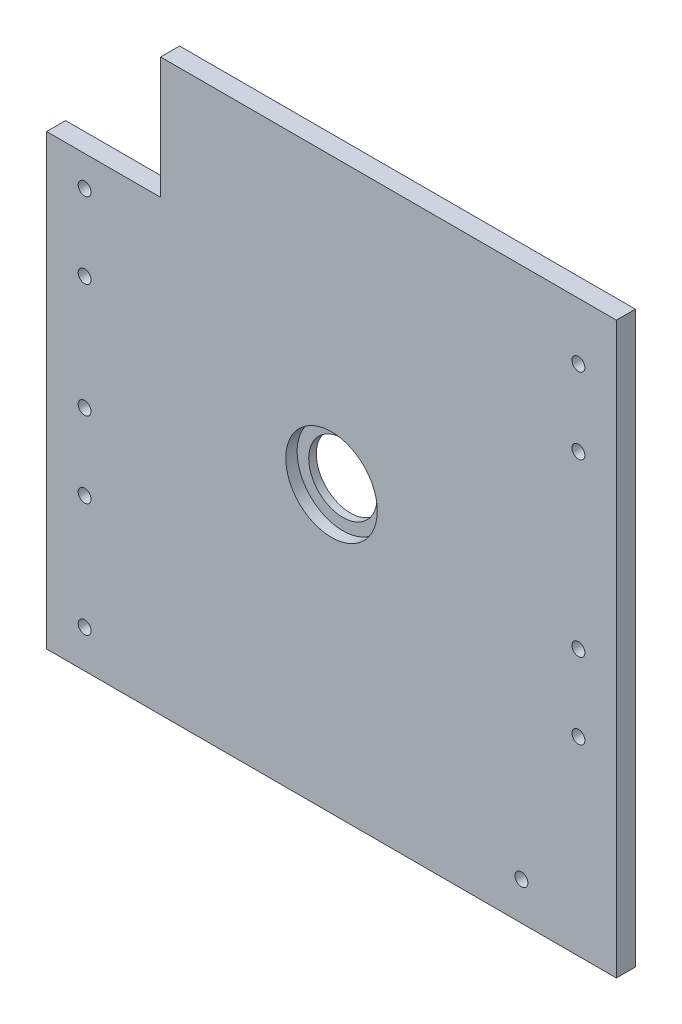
ISO-10303-21;
HEADER;
FILE_DESCRIPTION(('STEP AP214'),'2;1');
FILE_NAME('part.step','',(''),(''),'','','');
FILE_SCHEMA(('AUTOMOTIVE_DESIGN { 1 0 10303 214 1 1 1 1 }'));
ENDSEC;
DATA;
#1=APPLICATION_CONTEXT('core data for automotive mechanical design processes');
#2=APPLICATION_PROTOCOL_DEFINITION('international standard','automotive_design',2000,#1);
#3=PRODUCT_CONTEXT('',#1,'mechanical');
#4=PRODUCT('Part','Part','',(#3));
#5=PRODUCT_RELATED_PRODUCT_CATEGORY('part','',(#4));
#6=PRODUCT_DEFINITION_FORMATION('','',#4);
#7=PRODUCT_DEFINITION_CONTEXT('part definition',#1,'design');
#8=PRODUCT_DEFINITION('design','',#6,#7);
#9=PRODUCT_DEFINITION_SHAPE('','',#8);
#10=(LENGTH_UNIT() NAMED_UNIT(*) SI_UNIT(.MILLI.,.METRE.));
#11=(NAMED_UNIT(*) PLANE_ANGLE_UNIT() SI_UNIT($,.RADIAN.));
#12=(NAMED_UNIT(*) SI_UNIT($,.STERADIAN.) SOLID_ANGLE_UNIT());
#13=UNCERTAINTY_MEASURE_WITH_UNIT(LENGTH_MEASURE(1.E-05),#10,'distance_accuracy_value','');
#14=(GEOMETRIC_REPRESENTATION_CONTEXT(3) GLOBAL_UNCERTAINTY_ASSIGNED_CONTEXT((#13)) GLOBAL_UNIT_ASSIGNED_CONTEXT((#10,
#11,#12)) REPRESENTATION_CONTEXT('',''));
#15=CARTESIAN_POINT('',(0.,0.,0.));
#16=DIRECTION('',(0.,0.,1.));
#17=DIRECTION('',(1.,0.,0.));
#18=AXIS2_PLACEMENT_3D('',#15,#16,#17);
#19=CARTESIAN_POINT('',(0.,0.,5.));
#20=DIRECTION('',(0.,0.,-1.));
#21=DIRECTION('',(-1.,0.,0.));
#22=AXIS2_PLACEMENT_3D('',#19,#20,#21);
#23=CYLINDRICAL_SURFACE('',#22,9.);
#24=CARTESIAN_POINT('',(0.,0.,0.));
#25=DIRECTION('',(0.,0.,-1.));
#26=DIRECTION('',(-1.,0.,0.));
#27=AXIS2_PLACEMENT_3D('',#24,#25,#26);
#28=CIRCLE('',#27,9.);
#29=CARTESIAN_POINT('',(-9.,0.,0.));
#30=VERTEX_POINT('',#29);
#31=EDGE_CURVE('E132',#30,#30,#28,.T.);
#32=ORIENTED_EDGE('',*,*,#31,.T.);
#33=EDGE_LOOP('',(#32));
#34=FACE_BOUND('',#33,.T.);
#35=CARTESIAN_POINT('',(0.,0.,2.));
#36=DIRECTION('',(0.,0.,1.));
#37=DIRECTION('',(1.,0.,0.));
#38=AXIS2_PLACEMENT_3D('',#35,#36,#37);
#39=CIRCLE('',#38,9.);
#40=CARTESIAN_POINT('',(9.,0.,2.));
#41=VERTEX_POINT('',#40);
#42=EDGE_CURVE('E43',#41,#41,#39,.F.);
#43=ORIENTED_EDGE('',*,*,#42,.F.);
#44=EDGE_LOOP('',(#43));
#45=FACE_BOUND('',#44,.T.);
#46=ADVANCED_FACE('F39',(#34,#45),#23,.F.);
#47=CARTESIAN_POINT('',(75.,75.,5.));
#48=DIRECTION('',(-1.,0.,0.));
#49=DIRECTION('',(0.,0.,1.));
#50=AXIS2_PLACEMENT_3D('',#47,#48,#49);
#51=PLANE('',#50);
#52=DIRECTION('',(0.,1.,0.));
#53=VECTOR('',#52,1.);
#54=CARTESIAN_POINT('',(75.,75.,0.));
#55=LINE('',#54,#53);
#56=CARTESIAN_POINT('',(75.,-75.,0.));
#57=VERTEX_POINT('',#56);
#58=CARTESIAN_POINT('',(75.,75.,0.));
#59=VERTEX_POINT('',#58);
#60=EDGE_CURVE('E212',#57,#59,#55,.T.);
#61=ORIENTED_EDGE('',*,*,#60,.T.);
#62=DIRECTION('',(0.,0.,-1.));
#63=VECTOR('',#62,1.);
#64=CARTESIAN_POINT('',(75.,75.,5.));
#65=LINE('',#64,#63);
#66=CARTESIAN_POINT('',(75.,75.,5.));
#67=VERTEX_POINT('',#66);
#68=EDGE_CURVE('E11',#67,#59,#65,.T.);
#69=ORIENTED_EDGE('',*,*,#68,.F.);
#70=DIRECTION('',(0.,1.,0.));
#71=VECTOR('',#70,1.);
#72=CARTESIAN_POINT('',(75.,75.,5.));
#73=LINE('',#72,#71);
#74=CARTESIAN_POINT('',(75.,-75.,5.));
#75=VERTEX_POINT('',#74);
#76=EDGE_CURVE('E205',#75,#67,#73,.T.);
#77=ORIENTED_EDGE('',*,*,#76,.F.);
#78=DIRECTION('',(0.,0.,-1.));
#79=VECTOR('',#78,1.);
#80=CARTESIAN_POINT('',(75.,-75.,5.));
#81=LINE('',#80,#79);
#82=EDGE_CURVE('E211',#75,#57,#81,.T.);
#83=ORIENTED_EDGE('',*,*,#82,.T.);
#84=EDGE_LOOP('',(#61,#69,#77,#83));
#85=FACE_BOUND('',#84,.T.);
#86=ADVANCED_FACE('F41',(#85),#51,.F.);
#87=CARTESIAN_POINT('',(-75.,75.,5.));
#88=DIRECTION('',(0.,-1.,0.));
#89=DIRECTION('',(0.,0.,-1.));
#90=AXIS2_PLACEMENT_3D('',#87,#88,#89);
#91=PLANE('',#90);
#92=DIRECTION('',(-1.,0.,0.));
#93=VECTOR('',#92,1.);
#94=CARTESIAN_POINT('',(-75.,75.,0.));
#95=LINE('',#94,#93);
#96=CARTESIAN_POINT('',(-45.,75.,0.));
#97=VERTEX_POINT('',#96);
#98=EDGE_CURVE('E215',#59,#97,#95,.T.);
#99=ORIENTED_EDGE('',*,*,#98,.T.);
#100=DIRECTION('',(0.,0.,-1.));
#101=VECTOR('',#100,1.);
#102=CARTESIAN_POINT('',(-45.,75.,5.));
#103=LINE('',#102,#101);
#104=CARTESIAN_POINT('',(-45.,75.,5.));
#105=VERTEX_POINT('',#104);
#106=EDGE_CURVE('E123',#105,#97,#103,.T.);
#107=ORIENTED_EDGE('',*,*,#106,.F.);
#108=DIRECTION('',(-1.,0.,0.));
#109=VECTOR('',#108,1.);
#110=CARTESIAN_POINT('',(-75.,75.,5.));
#111=LINE('',#110,#109);
#112=EDGE_CURVE('E88',#67,#105,#111,.T.);
#113=ORIENTED_EDGE('',*,*,#112,.F.);
#114=ORIENTED_EDGE('',*,*,#68,.T.);
#115=EDGE_LOOP('',(#99,#107,#113,#114));
#116=FACE_BOUND('',#115,.T.);
#117=ADVANCED_FACE('F294',(#116),#91,.F.);
#118=CARTESIAN_POINT('',(-75.,75.,5.));
#119=DIRECTION('',(1.,0.,0.));
#120=DIRECTION('',(0.,1.,0.));
#121=AXIS2_PLACEMENT_3D('',#118,#119,#120);
#122=PLANE('',#121);
#123=DIRECTION('',(0.,-1.,0.));
#124=VECTOR('',#123,1.);
#125=CARTESIAN_POINT('',(-75.,75.,5.));
#126=LINE('',#125,#124);
#127=CARTESIAN_POINT('',(-75.,43.,5.));
#128=VERTEX_POINT('',#127);
#129=CARTESIAN_POINT('',(-75.,-75.,5.));
#130=VERTEX_POINT('',#129);
#131=EDGE_CURVE('E208',#128,#130,#126,.T.);
#132=ORIENTED_EDGE('',*,*,#131,.F.);
#133=DIRECTION('',(0.,0.,-1.));
#134=VECTOR('',#133,1.);
#135=CARTESIAN_POINT('',(-75.,43.,5.));
#136=LINE('',#135,#134);
#137=CARTESIAN_POINT('',(-75.,43.,0.));
#138=VERTEX_POINT('',#137);
#139=EDGE_CURVE('E108',#128,#138,#136,.T.);
#140=ORIENTED_EDGE('',*,*,#139,.T.);
#141=DIRECTION('',(0.,-1.,0.));
#142=VECTOR('',#141,1.);
#143=CARTESIAN_POINT('',(-75.,75.,0.));
#144=LINE('',#143,#142);
#145=CARTESIAN_POINT('',(-75.,-75.,0.));
#146=VERTEX_POINT('',#145);
#147=EDGE_CURVE('E218',#138,#146,#144,.T.);
#148=ORIENTED_EDGE('',*,*,#147,.T.);
#149=DIRECTION('',(0.,0.,-1.));
#150=VECTOR('',#149,1.);
#151=CARTESIAN_POINT('',(-75.,-75.,5.));
#152=LINE('',#151,#150);
#153=EDGE_CURVE('E48',#130,#146,#152,.T.);
#154=ORIENTED_EDGE('',*,*,#153,.F.);
#155=EDGE_LOOP('',(#132,#140,#148,#154));
#156=FACE_BOUND('',#155,.T.);
#157=ADVANCED_FACE('F288',(#156),#122,.F.);
#158=CARTESIAN_POINT('',(-75.,-75.,5.));
#159=DIRECTION('',(0.,1.,0.));
#160=DIRECTION('',(0.,0.,1.));
#161=AXIS2_PLACEMENT_3D('',#158,#159,#160);
#162=PLANE('',#161);
#163=DIRECTION('',(1.,0.,0.));
#164=VECTOR('',#163,1.);
#165=CARTESIAN_POINT('',(-75.,-75.,0.));
#166=LINE('',#165,#164);
#167=EDGE_CURVE('E82',#146,#57,#166,.T.);
#168=ORIENTED_EDGE('',*,*,#167,.T.);
#169=ORIENTED_EDGE('',*,*,#82,.F.);
#170=DIRECTION('',(1.,0.,0.));
#171=VECTOR('',#170,1.);
#172=CARTESIAN_POINT('',(-75.,-75.,5.));
#173=LINE('',#172,#171);
#174=EDGE_CURVE('E65',#130,#75,#173,.T.);
#175=ORIENTED_EDGE('',*,*,#174,.F.);
#176=ORIENTED_EDGE('',*,*,#153,.T.);
#177=EDGE_LOOP('',(#168,#169,#175,#176));
#178=FACE_BOUND('',#177,.T.);
#179=ADVANCED_FACE('F249',(#178),#162,.F.);
#180=CARTESIAN_POINT('',(0.,0.,5.));
#181=DIRECTION('',(0.,0.,1.));
#182=DIRECTION('',(1.,0.,0.));
#183=AXIS2_PLACEMENT_3D('',#180,#181,#182);
#184=PLANE('',#183);
#185=DIRECTION('',(0.,-1.,0.));
#186=VECTOR('',#185,1.);
#187=CARTESIAN_POINT('',(-45.,75.,5.));
#188=LINE('',#187,#186);
#189=CARTESIAN_POINT('',(-45.,43.,5.));
#190=VERTEX_POINT('',#189);
#191=EDGE_CURVE('E105',#105,#190,#188,.T.);
#192=ORIENTED_EDGE('',*,*,#191,.T.);
#193=DIRECTION('',(-1.,0.,0.));
#194=VECTOR('',#193,1.);
#195=CARTESIAN_POINT('',(-45.,43.,5.));
#196=LINE('',#195,#194);
#197=EDGE_CURVE('E109',#190,#128,#196,.T.);
#198=ORIENTED_EDGE('',*,*,#197,.T.);
#199=ORIENTED_EDGE('',*,*,#131,.T.);
#200=ORIENTED_EDGE('',*,*,#174,.T.);
#201=ORIENTED_EDGE('',*,*,#76,.T.);
#202=ORIENTED_EDGE('',*,*,#112,.T.);
#203=EDGE_LOOP('',(#192,#198,#199,#200,#201,#202));
#204=FACE_BOUND('',#203,.T.);
#205=CARTESIAN_POINT('',(0.,0.,5.));
#206=DIRECTION('',(0.,0.,1.));
#207=DIRECTION('',(1.,0.,0.));
#208=AXIS2_PLACEMENT_3D('',#205,#206,#207);
#209=CIRCLE('',#208,12.05);
#210=CARTESIAN_POINT('',(12.05,0.,5.));
#211=VERTEX_POINT('',#210);
#212=EDGE_CURVE('E125',#211,#211,#209,.T.);
#213=ORIENTED_EDGE('',*,*,#212,.F.);
#214=EDGE_LOOP('',(#213));
#215=FACE_BOUND('',#214,.T.);
#216=CARTESIAN_POINT('',(-65.,35.,5.));
#217=DIRECTION('',(0.,0.,1.));
#218=DIRECTION('',(1.,0.,0.));
#219=AXIS2_PLACEMENT_3D('',#216,#217,#218);
#220=CIRCLE('',#219,1.69999999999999);
#221=CARTESIAN_POINT('',(-63.3,35.,5.));
#222=VERTEX_POINT('',#221);
#223=EDGE_CURVE('E141',#222,#222,#220,.T.);
#224=ORIENTED_EDGE('',*,*,#223,.F.);
#225=EDGE_LOOP('',(#224));
#226=FACE_BOUND('',#225,.T.);
#227=CARTESIAN_POINT('',(-65.,15.,5.));
#228=DIRECTION('',(0.,0.,1.));
#229=DIRECTION('',(1.,0.,0.));
#230=AXIS2_PLACEMENT_3D('',#227,#228,#229);
#231=CIRCLE('',#230,1.69999999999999);
#232=CARTESIAN_POINT('',(-63.3,15.,5.));
#233=VERTEX_POINT('',#232);
#234=EDGE_CURVE('E148',#233,#233,#231,.T.);
#235=ORIENTED_EDGE('',*,*,#234,.F.);
#236=EDGE_LOOP('',(#235));
#237=FACE_BOUND('',#236,.T.);
#238=CARTESIAN_POINT('',(-65.,-15.,5.));
#239=DIRECTION('',(0.,0.,1.));
#240=DIRECTION('',(1.,0.,0.));
#241=AXIS2_PLACEMENT_3D('',#238,#239,#240);
#242=CIRCLE('',#241,1.69999999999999);
#243=CARTESIAN_POINT('',(-63.3,-15.,5.));
#244=VERTEX_POINT('',#243);
#245=EDGE_CURVE('E155',#244,#244,#242,.T.);
#246=ORIENTED_EDGE('',*,*,#245,.F.);
#247=EDGE_LOOP('',(#246));
#248=FACE_BOUND('',#247,.T.);
#249=CARTESIAN_POINT('',(-65.,-35.,5.));
#250=DIRECTION('',(0.,0.,1.));
#251=DIRECTION('',(1.,0.,0.));
#252=AXIS2_PLACEMENT_3D('',#249,#250,#251);
#253=CIRCLE('',#252,1.69999999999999);
#254=CARTESIAN_POINT('',(-63.3,-35.,5.));
#255=VERTEX_POINT('',#254);
#256=EDGE_CURVE('E162',#255,#255,#253,.T.);
#257=ORIENTED_EDGE('',*,*,#256,.F.);
#258=EDGE_LOOP('',(#257));
#259=FACE_BOUND('',#258,.T.);
#260=CARTESIAN_POINT('',(-65.,-65.,5.));
#261=DIRECTION('',(0.,0.,1.));
#262=DIRECTION('',(1.,0.,0.));
#263=AXIS2_PLACEMENT_3D('',#260,#261,#262);
#264=CIRCLE('',#263,1.69999999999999);
#265=CARTESIAN_POINT('',(-63.3,-65.,5.));
#266=VERTEX_POINT('',#265);
#267=EDGE_CURVE('E169',#266,#266,#264,.T.);
#268=ORIENTED_EDGE('',*,*,#267,.F.);
#269=EDGE_LOOP('',(#268));
#270=FACE_BOUND('',#269,.T.);
#271=CARTESIAN_POINT('',(65.,60.,5.));
#272=DIRECTION('',(0.,0.,1.));
#273=DIRECTION('',(1.,0.,0.));
#274=AXIS2_PLACEMENT_3D('',#271,#272,#273);
#275=CIRCLE('',#274,1.69999999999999);
#276=CARTESIAN_POINT('',(66.7,60.,5.));
#277=VERTEX_POINT('',#276);
#278=EDGE_CURVE('E176',#277,#277,#275,.T.);
#279=ORIENTED_EDGE('',*,*,#278,.F.);
#280=EDGE_LOOP('',(#279));
#281=FACE_BOUND('',#280,.T.);
#282=CARTESIAN_POINT('',(65.,40.,5.));
#283=DIRECTION('',(0.,0.,1.));
#284=DIRECTION('',(1.,0.,0.));
#285=AXIS2_PLACEMENT_3D('',#282,#283,#284);
#286=CIRCLE('',#285,1.69999999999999);
#287=CARTESIAN_POINT('',(66.7,40.,5.));
#288=VERTEX_POINT('',#287);
#289=EDGE_CURVE('E183',#288,#288,#286,.T.);
#290=ORIENTED_EDGE('',*,*,#289,.F.);
#291=EDGE_LOOP('',(#290));
#292=FACE_BOUND('',#291,.T.);
#293=CARTESIAN_POINT('',(65.,-4.99999999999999,5.));
#294=DIRECTION('',(0.,0.,1.));
#295=DIRECTION('',(1.,0.,0.));
#296=AXIS2_PLACEMENT_3D('',#293,#294,#295);
#297=CIRCLE('',#296,1.69999999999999);
#298=CARTESIAN_POINT('',(66.7,-4.99999999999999,5.));
#299=VERTEX_POINT('',#298);
#300=EDGE_CURVE('E190',#299,#299,#297,.T.);
#301=ORIENTED_EDGE('',*,*,#300,.F.);
#302=EDGE_LOOP('',(#301));
#303=FACE_BOUND('',#302,.T.);
#304=CARTESIAN_POINT('',(65.,-25.,5.));
#305=DIRECTION('',(0.,0.,1.));
#306=DIRECTION('',(1.,0.,0.));
#307=AXIS2_PLACEMENT_3D('',#304,#305,#306);
#308=CIRCLE('',#307,1.69999999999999);
#309=CARTESIAN_POINT('',(66.7,-25.,5.));
#310=VERTEX_POINT('',#309);
#311=EDGE_CURVE('E197',#310,#310,#308,.T.);
#312=ORIENTED_EDGE('',*,*,#311,.F.);
#313=EDGE_LOOP('',(#312));
#314=FACE_BOUND('',#313,.T.);
#315=CARTESIAN_POINT('',(50.,-65.,5.));
#316=DIRECTION('',(0.,0.,1.));
#317=DIRECTION('',(1.,0.,0.));
#318=AXIS2_PLACEMENT_3D('',#315,#316,#317);
#319=CIRCLE('',#318,1.69999999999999);
#320=CARTESIAN_POINT('',(51.7,-65.,5.));
#321=VERTEX_POINT('',#320);
#322=EDGE_CURVE('E204',#321,#321,#319,.T.);
#323=ORIENTED_EDGE('',*,*,#322,.F.);
#324=EDGE_LOOP('',(#323));
#325=FACE_BOUND('',#324,.T.);
#326=ADVANCED_FACE('F116',(#204,#215,#226,#237,#248,#259,#270,#281,#292,#303,#314,#325),#184,.T.);
#327=CARTESIAN_POINT('',(0.,0.,0.));
#328=DIRECTION('',(0.,0.,1.));
#329=DIRECTION('',(1.,0.,0.));
#330=AXIS2_PLACEMENT_3D('',#327,#328,#329);
#331=PLANE('',#330);
#332=ORIENTED_EDGE('',*,*,#31,.F.);
#333=EDGE_LOOP('',(#332));
#334=FACE_BOUND('',#333,.T.);
#335=CARTESIAN_POINT('',(-65.,35.,0.));
#336=DIRECTION('',(0.,0.,-1.));
#337=DIRECTION('',(-1.,0.,0.));
#338=AXIS2_PLACEMENT_3D('',#335,#336,#337);
#339=CIRCLE('',#338,3.3);
#340=CARTESIAN_POINT('',(-68.3,35.,0.));
#341=VERTEX_POINT('',#340);
#342=EDGE_CURVE('E135',#341,#341,#339,.T.);
#343=ORIENTED_EDGE('',*,*,#342,.F.);
#344=EDGE_LOOP('',(#343));
#345=FACE_BOUND('',#344,.T.);
#346=CARTESIAN_POINT('',(-65.,15.,0.));
#347=DIRECTION('',(0.,0.,-1.));
#348=DIRECTION('',(-1.,0.,0.));
#349=AXIS2_PLACEMENT_3D('',#346,#347,#348);
#350=CIRCLE('',#349,3.3);
#351=CARTESIAN_POINT('',(-68.3,15.,0.));
#352=VERTEX_POINT('',#351);
#353=EDGE_CURVE('E142',#352,#352,#350,.T.);
#354=ORIENTED_EDGE('',*,*,#353,.F.);
#355=EDGE_LOOP('',(#354));
#356=FACE_BOUND('',#355,.T.);
#357=CARTESIAN_POINT('',(-65.,-15.,0.));
#358=DIRECTION('',(0.,0.,-1.));
#359=DIRECTION('',(-1.,0.,0.));
#360=AXIS2_PLACEMENT_3D('',#357,#358,#359);
#361=CIRCLE('',#360,3.3);
#362=CARTESIAN_POINT('',(-68.3,-15.,0.));
#363=VERTEX_POINT('',#362);
#364=EDGE_CURVE('E149',#363,#363,#361,.T.);
#365=ORIENTED_EDGE('',*,*,#364,.F.);
#366=EDGE_LOOP('',(#365));
#367=FACE_BOUND('',#366,.T.);
#368=CARTESIAN_POINT('',(-65.,-35.,0.));
#369=DIRECTION('',(0.,0.,-1.));
#370=DIRECTION('',(-1.,0.,0.));
#371=AXIS2_PLACEMENT_3D('',#368,#369,#370);
#372=CIRCLE('',#371,3.3);
#373=CARTESIAN_POINT('',(-68.3,-35.,0.));
#374=VERTEX_POINT('',#373);
#375=EDGE_CURVE('E156',#374,#374,#372,.T.);
#376=ORIENTED_EDGE('',*,*,#375,.F.);
#377=EDGE_LOOP('',(#376));
#378=FACE_BOUND('',#377,.T.);
#379=CARTESIAN_POINT('',(-65.,-65.,0.));
#380=DIRECTION('',(0.,0.,-1.));
#381=DIRECTION('',(-1.,0.,0.));
#382=AXIS2_PLACEMENT_3D('',#379,#380,#381);
#383=CIRCLE('',#382,3.3);
#384=CARTESIAN_POINT('',(-68.3,-65.,0.));
#385=VERTEX_POINT('',#384);
#386=EDGE_CURVE('E163',#385,#385,#383,.T.);
#387=ORIENTED_EDGE('',*,*,#386,.F.);
#388=EDGE_LOOP('',(#387));
#389=FACE_BOUND('',#388,.T.);
#390=CARTESIAN_POINT('',(65.,60.,0.));
#391=DIRECTION('',(0.,0.,-1.));
#392=DIRECTION('',(-1.,0.,0.));
#393=AXIS2_PLACEMENT_3D('',#390,#391,#392);
#394=CIRCLE('',#393,3.3);
#395=CARTESIAN_POINT('',(61.7,60.,0.));
#396=VERTEX_POINT('',#395);
#397=EDGE_CURVE('E170',#396,#396,#394,.T.);
#398=ORIENTED_EDGE('',*,*,#397,.F.);
#399=EDGE_LOOP('',(#398));
#400=FACE_BOUND('',#399,.T.);
#401=CARTESIAN_POINT('',(65.,40.,0.));
#402=DIRECTION('',(0.,0.,-1.));
#403=DIRECTION('',(-1.,0.,0.));
#404=AXIS2_PLACEMENT_3D('',#401,#402,#403);
#405=CIRCLE('',#404,3.3);
#406=CARTESIAN_POINT('',(61.7,40.,0.));
#407=VERTEX_POINT('',#406);
#408=EDGE_CURVE('E177',#407,#407,#405,.T.);
#409=ORIENTED_EDGE('',*,*,#408,.F.);
#410=EDGE_LOOP('',(#409));
#411=FACE_BOUND('',#410,.T.);
#412=CARTESIAN_POINT('',(65.,-4.99999999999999,0.));
#413=DIRECTION('',(0.,0.,-1.));
#414=DIRECTION('',(-1.,0.,0.));
#415=AXIS2_PLACEMENT_3D('',#412,#413,#414);
#416=CIRCLE('',#415,3.3);
#417=CARTESIAN_POINT('',(61.7,-4.99999999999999,0.));
#418=VERTEX_POINT('',#417);
#419=EDGE_CURVE('E184',#418,#418,#416,.T.);
#420=ORIENTED_EDGE('',*,*,#419,.F.);
#421=EDGE_LOOP('',(#420));
#422=FACE_BOUND('',#421,.T.);
#423=CARTESIAN_POINT('',(65.,-25.,0.));
#424=DIRECTION('',(0.,0.,-1.));
#425=DIRECTION('',(-1.,0.,0.));
#426=AXIS2_PLACEMENT_3D('',#423,#424,#425);
#427=CIRCLE('',#426,3.3);
#428=CARTESIAN_POINT('',(61.7,-25.,0.));
#429=VERTEX_POINT('',#428);
#430=EDGE_CURVE('E191',#429,#429,#427,.T.);
#431=ORIENTED_EDGE('',*,*,#430,.F.);
#432=EDGE_LOOP('',(#431));
#433=FACE_BOUND('',#432,.T.);
#434=CARTESIAN_POINT('',(50.,-65.,0.));
#435=DIRECTION('',(0.,0.,-1.));
#436=DIRECTION('',(-1.,0.,0.));
#437=AXIS2_PLACEMENT_3D('',#434,#435,#436);
#438=CIRCLE('',#437,3.3);
#439=CARTESIAN_POINT('',(46.7,-65.,0.));
#440=VERTEX_POINT('',#439);
#441=EDGE_CURVE('E198',#440,#440,#438,.T.);
#442=ORIENTED_EDGE('',*,*,#441,.F.);
#443=EDGE_LOOP('',(#442));
#444=FACE_BOUND('',#443,.T.);
#445=DIRECTION('',(-1.,0.,0.));
#446=VECTOR('',#445,1.);
#447=CARTESIAN_POINT('',(-45.,43.,0.));
#448=LINE('',#447,#446);
#449=CARTESIAN_POINT('',(-45.,43.,0.));
#450=VERTEX_POINT('',#449);
#451=EDGE_CURVE('E118',#450,#138,#448,.T.);
#452=ORIENTED_EDGE('',*,*,#451,.F.);
#453=DIRECTION('',(0.,-1.,0.));
#454=VECTOR('',#453,1.);
#455=CARTESIAN_POINT('',(-45.,75.,0.));
#456=LINE('',#455,#454);
#457=EDGE_CURVE('E56',#97,#450,#456,.T.);
#458=ORIENTED_EDGE('',*,*,#457,.F.);
#459=ORIENTED_EDGE('',*,*,#98,.F.);
#460=ORIENTED_EDGE('',*,*,#60,.F.);
#461=ORIENTED_EDGE('',*,*,#167,.F.);
#462=ORIENTED_EDGE('',*,*,#147,.F.);
#463=EDGE_LOOP('',(#452,#458,#459,#460,#461,#462));
#464=FACE_BOUND('',#463,.T.);
#465=ADVANCED_FACE('F248',(#334,#345,#356,#367,#378,#389,#400,#411,#422,#433,#444,#464),#331,.F.);
#466=CARTESIAN_POINT('',(50.,-65.,0.));
#467=DIRECTION('',(0.,0.,-1.));
#468=DIRECTION('',(-1.,0.,0.));
#469=AXIS2_PLACEMENT_3D('',#466,#467,#468);
#470=CYLINDRICAL_SURFACE('',#469,1.69999999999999);
#471=ORIENTED_EDGE('',*,*,#322,.T.);
#472=EDGE_LOOP('',(#471));
#473=FACE_BOUND('',#472,.T.);
#474=CARTESIAN_POINT('',(50.,-65.,1.60000000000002));
#475=DIRECTION('',(0.,0.,-1.));
#476=DIRECTION('',(-1.,0.,0.));
#477=AXIS2_PLACEMENT_3D('',#474,#475,#476);
#478=CIRCLE('',#477,1.69999999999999);
#479=CARTESIAN_POINT('',(48.3,-65.,1.60000000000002));
#480=VERTEX_POINT('',#479);
#481=EDGE_CURVE('E201',#480,#480,#478,.T.);
#482=ORIENTED_EDGE('',*,*,#481,.T.);
#483=EDGE_LOOP('',(#482));
#484=FACE_BOUND('',#483,.T.);
#485=ADVANCED_FACE('F269',(#473,#484),#470,.F.);
#486=CARTESIAN_POINT('',(50.,-65.,0.));
#487=DIRECTION('',(0.,0.,-1.));
#488=DIRECTION('',(-1.,0.,0.));
#489=AXIS2_PLACEMENT_3D('',#486,#487,#488);
#490=CONICAL_SURFACE('',#489,3.3,0.785398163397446);
#491=ORIENTED_EDGE('',*,*,#481,.F.);
#492=EDGE_LOOP('',(#491));
#493=FACE_BOUND('',#492,.T.);
#494=ORIENTED_EDGE('',*,*,#441,.T.);
#495=EDGE_LOOP('',(#494));
#496=FACE_BOUND('',#495,.T.);
#497=ADVANCED_FACE('F272',(#493,#496),#490,.F.);
#498=CARTESIAN_POINT('',(65.,-25.,0.));
#499=DIRECTION('',(0.,0.,-1.));
#500=DIRECTION('',(-1.,0.,0.));
#501=AXIS2_PLACEMENT_3D('',#498,#499,#500);
#502=CYLINDRICAL_SURFACE('',#501,1.69999999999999);
#503=ORIENTED_EDGE('',*,*,#311,.T.);
#504=EDGE_LOOP('',(#503));
#505=FACE_BOUND('',#504,.T.);
#506=CARTESIAN_POINT('',(65.,-25.,1.60000000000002));
#507=DIRECTION('',(0.,0.,-1.));
#508=DIRECTION('',(-1.,0.,0.));
#509=AXIS2_PLACEMENT_3D('',#506,#507,#508);
#510=CIRCLE('',#509,1.69999999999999);
#511=CARTESIAN_POINT('',(63.3,-25.,1.60000000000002));
#512=VERTEX_POINT('',#511);
#513=EDGE_CURVE('E194',#512,#512,#510,.T.);
#514=ORIENTED_EDGE('',*,*,#513,.T.);
#515=EDGE_LOOP('',(#514));
#516=FACE_BOUND('',#515,.T.);
#517=ADVANCED_FACE('F278',(#505,#516),#502,.F.);
#518=CARTESIAN_POINT('',(65.,-25.,0.));
#519=DIRECTION('',(0.,0.,-1.));
#520=DIRECTION('',(-1.,0.,0.));
#521=AXIS2_PLACEMENT_3D('',#518,#519,#520);
#522=CONICAL_SURFACE('',#521,3.3,0.785398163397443);
#523=ORIENTED_EDGE('',*,*,#513,.F.);
#524=EDGE_LOOP('',(#523));
#525=FACE_BOUND('',#524,.T.);
#526=ORIENTED_EDGE('',*,*,#430,.T.);
#527=EDGE_LOOP('',(#526));
#528=FACE_BOUND('',#527,.T.);
#529=ADVANCED_FACE('F373',(#525,#528),#522,.F.);
#530=CARTESIAN_POINT('',(65.,-4.99999999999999,0.));
#531=DIRECTION('',(0.,0.,-1.));
#532=DIRECTION('',(-1.,0.,0.));
#533=AXIS2_PLACEMENT_3D('',#530,#531,#532);
#534=CYLINDRICAL_SURFACE('',#533,1.69999999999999);
#535=ORIENTED_EDGE('',*,*,#300,.T.);
#536=EDGE_LOOP('',(#535));
#537=FACE_BOUND('',#536,.T.);
#538=CARTESIAN_POINT('',(65.,-4.99999999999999,1.60000000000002));
#539=DIRECTION('',(0.,0.,-1.));
#540=DIRECTION('',(-1.,0.,0.));
#541=AXIS2_PLACEMENT_3D('',#538,#539,#540);
#542=CIRCLE('',#541,1.69999999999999);
#543=CARTESIAN_POINT('',(63.3,-4.99999999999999,1.60000000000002));
#544=VERTEX_POINT('',#543);
#545=EDGE_CURVE('E187',#544,#544,#542,.T.);
#546=ORIENTED_EDGE('',*,*,#545,.T.);
#547=EDGE_LOOP('',(#546));
#548=FACE_BOUND('',#547,.T.);
#549=ADVANCED_FACE('F369',(#537,#548),#534,.F.);
#550=CARTESIAN_POINT('',(65.,-4.99999999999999,0.));
#551=DIRECTION('',(0.,0.,-1.));
#552=DIRECTION('',(-1.,0.,0.));
#553=AXIS2_PLACEMENT_3D('',#550,#551,#552);
#554=CONICAL_SURFACE('',#553,3.3,0.785398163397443);
#555=ORIENTED_EDGE('',*,*,#545,.F.);
#556=EDGE_LOOP('',(#555));
#557=FACE_BOUND('',#556,.T.);
#558=ORIENTED_EDGE('',*,*,#419,.T.);
#559=EDGE_LOOP('',(#558));
#560=FACE_BOUND('',#559,.T.);
#561=ADVANCED_FACE('F365',(#557,#560),#554,.F.);
#562=CARTESIAN_POINT('',(65.,40.,0.));
#563=DIRECTION('',(0.,0.,-1.));
#564=DIRECTION('',(-1.,0.,0.));
#565=AXIS2_PLACEMENT_3D('',#562,#563,#564);
#566=CYLINDRICAL_SURFACE('',#565,1.69999999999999);
#567=ORIENTED_EDGE('',*,*,#289,.T.);
#568=EDGE_LOOP('',(#567));
#569=FACE_BOUND('',#568,.T.);
#570=CARTESIAN_POINT('',(65.,40.,1.60000000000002));
#571=DIRECTION('',(0.,0.,-1.));
#572=DIRECTION('',(-1.,0.,0.));
#573=AXIS2_PLACEMENT_3D('',#570,#571,#572);
#574=CIRCLE('',#573,1.69999999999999);
#575=CARTESIAN_POINT('',(63.3,40.,1.60000000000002));
#576=VERTEX_POINT('',#575);
#577=EDGE_CURVE('E180',#576,#576,#574,.T.);
#578=ORIENTED_EDGE('',*,*,#577,.T.);
#579=EDGE_LOOP('',(#578));
#580=FACE_BOUND('',#579,.T.);
#581=ADVANCED_FACE('F361',(#569,#580),#566,.F.);
#582=CARTESIAN_POINT('',(65.,40.,0.));
#583=DIRECTION('',(0.,0.,-1.));
#584=DIRECTION('',(-1.,0.,0.));
#585=AXIS2_PLACEMENT_3D('',#582,#583,#584);
#586=CONICAL_SURFACE('',#585,3.3,0.785398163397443);
#587=ORIENTED_EDGE('',*,*,#577,.F.);
#588=EDGE_LOOP('',(#587));
#589=FACE_BOUND('',#588,.T.);
#590=ORIENTED_EDGE('',*,*,#408,.T.);
#591=EDGE_LOOP('',(#590));
#592=FACE_BOUND('',#591,.T.);
#593=ADVANCED_FACE('F357',(#589,#592),#586,.F.);
#594=CARTESIAN_POINT('',(65.,60.,0.));
#595=DIRECTION('',(0.,0.,-1.));
#596=DIRECTION('',(-1.,0.,0.));
#597=AXIS2_PLACEMENT_3D('',#594,#595,#596);
#598=CYLINDRICAL_SURFACE('',#597,1.69999999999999);
#599=ORIENTED_EDGE('',*,*,#278,.T.);
#600=EDGE_LOOP('',(#599));
#601=FACE_BOUND('',#600,.T.);
#602=CARTESIAN_POINT('',(65.,60.,1.60000000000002));
#603=DIRECTION('',(0.,0.,-1.));
#604=DIRECTION('',(-1.,0.,0.));
#605=AXIS2_PLACEMENT_3D('',#602,#603,#604);
#606=CIRCLE('',#605,1.69999999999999);
#607=CARTESIAN_POINT('',(63.3,60.,1.60000000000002));
#608=VERTEX_POINT('',#607);
#609=EDGE_CURVE('E173',#608,#608,#606,.T.);
#610=ORIENTED_EDGE('',*,*,#609,.T.);
#611=EDGE_LOOP('',(#610));
#612=FACE_BOUND('',#611,.T.);
#613=ADVANCED_FACE('F353',(#601,#612),#598,.F.);
#614=CARTESIAN_POINT('',(65.,60.,0.));
#615=DIRECTION('',(0.,0.,-1.));
#616=DIRECTION('',(-1.,0.,0.));
#617=AXIS2_PLACEMENT_3D('',#614,#615,#616);
#618=CONICAL_SURFACE('',#617,3.3,0.785398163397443);
#619=ORIENTED_EDGE('',*,*,#609,.F.);
#620=EDGE_LOOP('',(#619));
#621=FACE_BOUND('',#620,.T.);
#622=ORIENTED_EDGE('',*,*,#397,.T.);
#623=EDGE_LOOP('',(#622));
#624=FACE_BOUND('',#623,.T.);
#625=ADVANCED_FACE('F349',(#621,#624),#618,.F.);
#626=CARTESIAN_POINT('',(-65.,-65.,0.));
#627=DIRECTION('',(0.,0.,-1.));
#628=DIRECTION('',(-1.,0.,0.));
#629=AXIS2_PLACEMENT_3D('',#626,#627,#628);
#630=CYLINDRICAL_SURFACE('',#629,1.69999999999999);
#631=ORIENTED_EDGE('',*,*,#267,.T.);
#632=EDGE_LOOP('',(#631));
#633=FACE_BOUND('',#632,.T.);
#634=CARTESIAN_POINT('',(-65.,-65.,1.60000000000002));
#635=DIRECTION('',(0.,0.,-1.));
#636=DIRECTION('',(-1.,0.,0.));
#637=AXIS2_PLACEMENT_3D('',#634,#635,#636);
#638=CIRCLE('',#637,1.69999999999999);
#639=CARTESIAN_POINT('',(-66.7,-65.,1.60000000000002));
#640=VERTEX_POINT('',#639);
#641=EDGE_CURVE('E166',#640,#640,#638,.T.);
#642=ORIENTED_EDGE('',*,*,#641,.T.);
#643=EDGE_LOOP('',(#642));
#644=FACE_BOUND('',#643,.T.);
#645=ADVANCED_FACE('F345',(#633,#644),#630,.F.);
#646=CARTESIAN_POINT('',(-65.,-65.,0.));
#647=DIRECTION('',(0.,0.,-1.));
#648=DIRECTION('',(-1.,0.,0.));
#649=AXIS2_PLACEMENT_3D('',#646,#647,#648);
#650=CONICAL_SURFACE('',#649,3.3,0.785398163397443);
#651=ORIENTED_EDGE('',*,*,#641,.F.);
#652=EDGE_LOOP('',(#651));
#653=FACE_BOUND('',#652,.T.);
#654=ORIENTED_EDGE('',*,*,#386,.T.);
#655=EDGE_LOOP('',(#654));
#656=FACE_BOUND('',#655,.T.);
#657=ADVANCED_FACE('F341',(#653,#656),#650,.F.);
#658=CARTESIAN_POINT('',(-65.,-35.,0.));
#659=DIRECTION('',(0.,0.,-1.));
#660=DIRECTION('',(-1.,0.,0.));
#661=AXIS2_PLACEMENT_3D('',#658,#659,#660);
#662=CYLINDRICAL_SURFACE('',#661,1.69999999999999);
#663=ORIENTED_EDGE('',*,*,#256,.T.);
#664=EDGE_LOOP('',(#663));
#665=FACE_BOUND('',#664,.T.);
#666=CARTESIAN_POINT('',(-65.,-35.,1.60000000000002));
#667=DIRECTION('',(0.,0.,-1.));
#668=DIRECTION('',(-1.,0.,0.));
#669=AXIS2_PLACEMENT_3D('',#666,#667,#668);
#670=CIRCLE('',#669,1.69999999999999);
#671=CARTESIAN_POINT('',(-66.7,-35.,1.60000000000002));
#672=VERTEX_POINT('',#671);
#673=EDGE_CURVE('E159',#672,#672,#670,.T.);
#674=ORIENTED_EDGE('',*,*,#673,.T.);
#675=EDGE_LOOP('',(#674));
#676=FACE_BOUND('',#675,.T.);
#677=ADVANCED_FACE('F337',(#665,#676),#662,.F.);
#678=CARTESIAN_POINT('',(-65.,-35.,0.));
#679=DIRECTION('',(0.,0.,-1.));
#680=DIRECTION('',(-1.,0.,0.));
#681=AXIS2_PLACEMENT_3D('',#678,#679,#680);
#682=CONICAL_SURFACE('',#681,3.3,0.785398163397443);
#683=ORIENTED_EDGE('',*,*,#673,.F.);
#684=EDGE_LOOP('',(#683));
#685=FACE_BOUND('',#684,.T.);
#686=ORIENTED_EDGE('',*,*,#375,.T.);
#687=EDGE_LOOP('',(#686));
#688=FACE_BOUND('',#687,.T.);
#689=ADVANCED_FACE('F333',(#685,#688),#682,.F.);
#690=CARTESIAN_POINT('',(-65.,-15.,0.));
#691=DIRECTION('',(0.,0.,-1.));
#692=DIRECTION('',(-1.,0.,0.));
#693=AXIS2_PLACEMENT_3D('',#690,#691,#692);
#694=CYLINDRICAL_SURFACE('',#693,1.69999999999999);
#695=ORIENTED_EDGE('',*,*,#245,.T.);
#696=EDGE_LOOP('',(#695));
#697=FACE_BOUND('',#696,.T.);
#698=CARTESIAN_POINT('',(-65.,-15.,1.60000000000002));
#699=DIRECTION('',(0.,0.,-1.));
#700=DIRECTION('',(-1.,0.,0.));
#701=AXIS2_PLACEMENT_3D('',#698,#699,#700);
#702=CIRCLE('',#701,1.69999999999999);
#703=CARTESIAN_POINT('',(-66.7,-15.,1.60000000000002));
#704=VERTEX_POINT('',#703);
#705=EDGE_CURVE('E152',#704,#704,#702,.T.);
#706=ORIENTED_EDGE('',*,*,#705,.T.);
#707=EDGE_LOOP('',(#706));
#708=FACE_BOUND('',#707,.T.);
#709=ADVANCED_FACE('F329',(#697,#708),#694,.F.);
#710=CARTESIAN_POINT('',(-65.,-15.,0.));
#711=DIRECTION('',(0.,0.,-1.));
#712=DIRECTION('',(-1.,0.,0.));
#713=AXIS2_PLACEMENT_3D('',#710,#711,#712);
#714=CONICAL_SURFACE('',#713,3.3,0.785398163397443);
#715=ORIENTED_EDGE('',*,*,#705,.F.);
#716=EDGE_LOOP('',(#715));
#717=FACE_BOUND('',#716,.T.);
#718=ORIENTED_EDGE('',*,*,#364,.T.);
#719=EDGE_LOOP('',(#718));
#720=FACE_BOUND('',#719,.T.);
#721=ADVANCED_FACE('F325',(#717,#720),#714,.F.);
#722=CARTESIAN_POINT('',(-65.,15.,0.));
#723=DIRECTION('',(0.,0.,-1.));
#724=DIRECTION('',(-1.,0.,0.));
#725=AXIS2_PLACEMENT_3D('',#722,#723,#724);
#726=CYLINDRICAL_SURFACE('',#725,1.69999999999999);
#727=ORIENTED_EDGE('',*,*,#234,.T.);
#728=EDGE_LOOP('',(#727));
#729=FACE_BOUND('',#728,.T.);
#730=CARTESIAN_POINT('',(-65.,15.,1.60000000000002));
#731=DIRECTION('',(0.,0.,-1.));
#732=DIRECTION('',(-1.,0.,0.));
#733=AXIS2_PLACEMENT_3D('',#730,#731,#732);
#734=CIRCLE('',#733,1.69999999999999);
#735=CARTESIAN_POINT('',(-66.7,15.,1.60000000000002));
#736=VERTEX_POINT('',#735);
#737=EDGE_CURVE('E145',#736,#736,#734,.T.);
#738=ORIENTED_EDGE('',*,*,#737,.T.);
#739=EDGE_LOOP('',(#738));
#740=FACE_BOUND('',#739,.T.);
#741=ADVANCED_FACE('F321',(#729,#740),#726,.F.);
#742=CARTESIAN_POINT('',(-65.,15.,0.));
#743=DIRECTION('',(0.,0.,-1.));
#744=DIRECTION('',(-1.,0.,0.));
#745=AXIS2_PLACEMENT_3D('',#742,#743,#744);
#746=CONICAL_SURFACE('',#745,3.3,0.785398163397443);
#747=ORIENTED_EDGE('',*,*,#737,.F.);
#748=EDGE_LOOP('',(#747));
#749=FACE_BOUND('',#748,.T.);
#750=ORIENTED_EDGE('',*,*,#353,.T.);
#751=EDGE_LOOP('',(#750));
#752=FACE_BOUND('',#751,.T.);
#753=ADVANCED_FACE('F318',(#749,#752),#746,.F.);
#754=CARTESIAN_POINT('',(-65.,35.,0.));
#755=DIRECTION('',(0.,0.,-1.));
#756=DIRECTION('',(-1.,0.,0.));
#757=AXIS2_PLACEMENT_3D('',#754,#755,#756);
#758=CYLINDRICAL_SURFACE('',#757,1.69999999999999);
#759=ORIENTED_EDGE('',*,*,#223,.T.);
#760=EDGE_LOOP('',(#759));
#761=FACE_BOUND('',#760,.T.);
#762=CARTESIAN_POINT('',(-65.,35.,1.60000000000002));
#763=DIRECTION('',(0.,0.,-1.));
#764=DIRECTION('',(-1.,0.,0.));
#765=AXIS2_PLACEMENT_3D('',#762,#763,#764);
#766=CIRCLE('',#765,1.69999999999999);
#767=CARTESIAN_POINT('',(-66.7,35.,1.60000000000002));
#768=VERTEX_POINT('',#767);
#769=EDGE_CURVE('E138',#768,#768,#766,.T.);
#770=ORIENTED_EDGE('',*,*,#769,.T.);
#771=EDGE_LOOP('',(#770));
#772=FACE_BOUND('',#771,.T.);
#773=ADVANCED_FACE('F243',(#761,#772),#758,.F.);
#774=CARTESIAN_POINT('',(-65.,35.,0.));
#775=DIRECTION('',(0.,0.,-1.));
#776=DIRECTION('',(-1.,0.,0.));
#777=AXIS2_PLACEMENT_3D('',#774,#775,#776);
#778=CONICAL_SURFACE('',#777,3.3,0.785398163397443);
#779=ORIENTED_EDGE('',*,*,#769,.F.);
#780=EDGE_LOOP('',(#779));
#781=FACE_BOUND('',#780,.T.);
#782=ORIENTED_EDGE('',*,*,#342,.T.);
#783=EDGE_LOOP('',(#782));
#784=FACE_BOUND('',#783,.T.);
#785=ADVANCED_FACE('F311',(#781,#784),#778,.F.);
#786=CARTESIAN_POINT('',(0.,0.,2.));
#787=DIRECTION('',(0.,0.,1.));
#788=DIRECTION('',(1.,0.,0.));
#789=AXIS2_PLACEMENT_3D('',#786,#787,#788);
#790=PLANE('',#789);
#791=CARTESIAN_POINT('',(0.,0.,2.));
#792=DIRECTION('',(0.,0.,1.));
#793=DIRECTION('',(1.,0.,0.));
#794=AXIS2_PLACEMENT_3D('',#791,#792,#793);
#795=CIRCLE('',#794,12.05);
#796=CARTESIAN_POINT('',(12.05,0.,2.));
#797=VERTEX_POINT('',#796);
#798=EDGE_CURVE('E127',#797,#797,#795,.T.);
#799=ORIENTED_EDGE('',*,*,#798,.T.);
#800=EDGE_LOOP('',(#799));
#801=FACE_BOUND('',#800,.T.);
#802=ORIENTED_EDGE('',*,*,#42,.T.);
#803=EDGE_LOOP('',(#802));
#804=FACE_BOUND('',#803,.T.);
#805=ADVANCED_FACE('F314',(#801,#804),#790,.T.);
#806=CARTESIAN_POINT('',(0.,0.,2.));
#807=DIRECTION('',(0.,0.,1.));
#808=DIRECTION('',(1.,0.,0.));
#809=AXIS2_PLACEMENT_3D('',#806,#807,#808);
#810=CYLINDRICAL_SURFACE('',#809,12.05);
#811=ORIENTED_EDGE('',*,*,#798,.F.);
#812=EDGE_LOOP('',(#811));
#813=FACE_BOUND('',#812,.T.);
#814=ORIENTED_EDGE('',*,*,#212,.T.);
#815=EDGE_LOOP('',(#814));
#816=FACE_BOUND('',#815,.T.);
#817=ADVANCED_FACE('F309',(#813,#816),#810,.F.);
#818=CARTESIAN_POINT('',(-45.,75.,5.));
#819=DIRECTION('',(1.,0.,0.));
#820=DIRECTION('',(0.,1.,0.));
#821=AXIS2_PLACEMENT_3D('',#818,#819,#820);
#822=PLANE('',#821);
#823=ORIENTED_EDGE('',*,*,#457,.T.);
#824=DIRECTION('',(0.,0.,-1.));
#825=VECTOR('',#824,1.);
#826=CARTESIAN_POINT('',(-45.,43.,5.));
#827=LINE('',#826,#825);
#828=EDGE_CURVE('E101',#190,#450,#827,.T.);
#829=ORIENTED_EDGE('',*,*,#828,.F.);
#830=ORIENTED_EDGE('',*,*,#191,.F.);
#831=ORIENTED_EDGE('',*,*,#106,.T.);
#832=EDGE_LOOP('',(#823,#829,#830,#831));
#833=FACE_BOUND('',#832,.T.);
#834=ADVANCED_FACE('F103',(#833),#822,.F.);
#835=CARTESIAN_POINT('',(-45.,43.,5.));
#836=DIRECTION('',(0.,-1.,0.));
#837=DIRECTION('',(0.,0.,-1.));
#838=AXIS2_PLACEMENT_3D('',#835,#836,#837);
#839=PLANE('',#838);
#840=ORIENTED_EDGE('',*,*,#451,.T.);
#841=ORIENTED_EDGE('',*,*,#139,.F.);
#842=ORIENTED_EDGE('',*,*,#197,.F.);
#843=ORIENTED_EDGE('',*,*,#828,.T.);
#844=EDGE_LOOP('',(#840,#841,#842,#843));
#845=FACE_BOUND('',#844,.T.);
#846=ADVANCED_FACE('F112',(#845),#839,.F.);
#847=CLOSED_SHELL('',(#46,#86,#117,#157,#179,#326,#465,#485,#497,#517,#529,#549,#561,#581,#593,
#613,#625,#645,#657,#677,#689,#709,#721,#741,#753,#773,#785,#805,#817,#834,#846));
#848=MANIFOLD_SOLID_BREP('B2',#847);
#849=ADVANCED_BREP_SHAPE_REPRESENTATION('',(#18,#848),#14);
#850=SHAPE_DEFINITION_REPRESENTATION(#9,#849);
ENDSEC;
END-ISO-10303-21;
